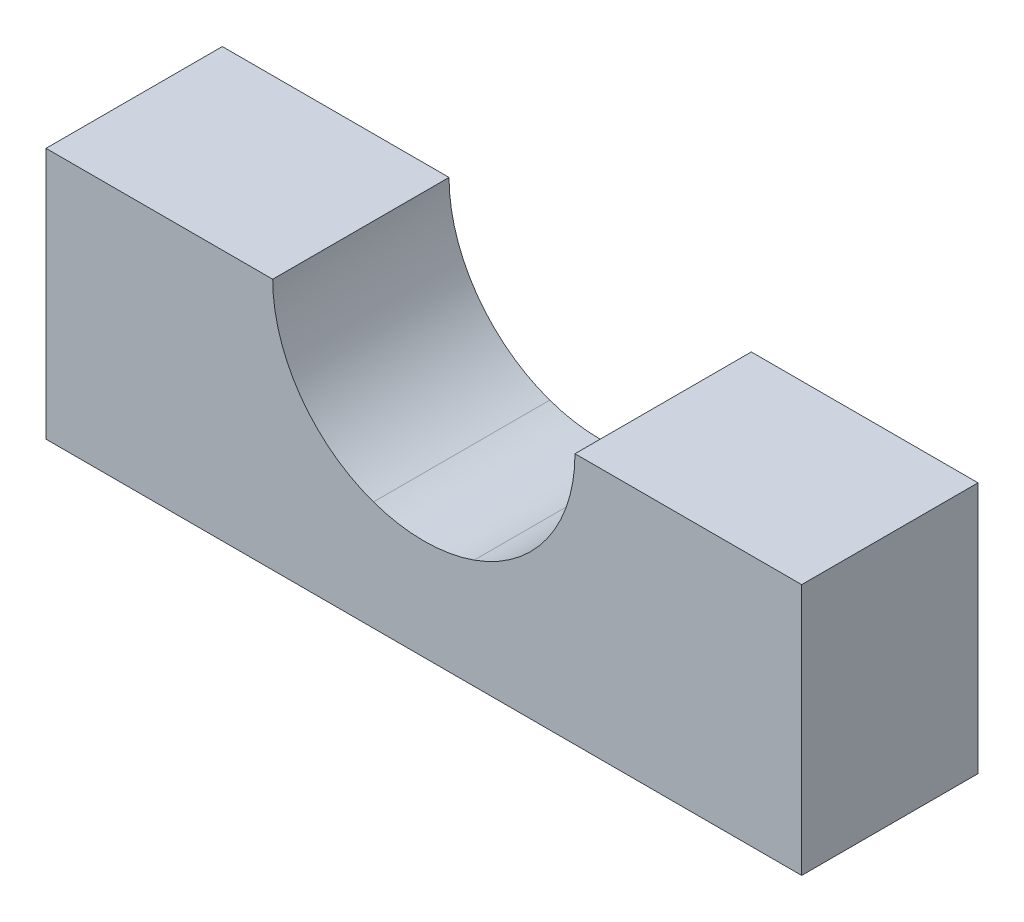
from build123d import *

# Parameters (mm, degrees)
SKETCH1_W          = 300
SKETCH1_H          = 100
EXTRUDE1_DEPTH     = 70
CUT_EXTRUDE1_DEPTH = 324.882694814


with BuildPart() as part:
    # Sketch1 → Extrude1 (new body)
    with BuildSketch(Plane.XY):
        with Locations((150, 50)):
            Rectangle(SKETCH1_W, SKETCH1_H)
    extrude(amount=EXTRUDE1_DEPTH)

    # Sketch2 → Cut-Extrude1 (cut, through all)
    with BuildSketch(Plane.XY.offset(70)):
        with BuildLine():
            Line((210, 100), (90, 100))
            ThreePointArc((90, 100), (150, 40), (210, 100))
        make_face()
    extrude(amount=-CUT_EXTRUDE1_DEPTH, mode=Mode.SUBTRACT)


solid = part.part
